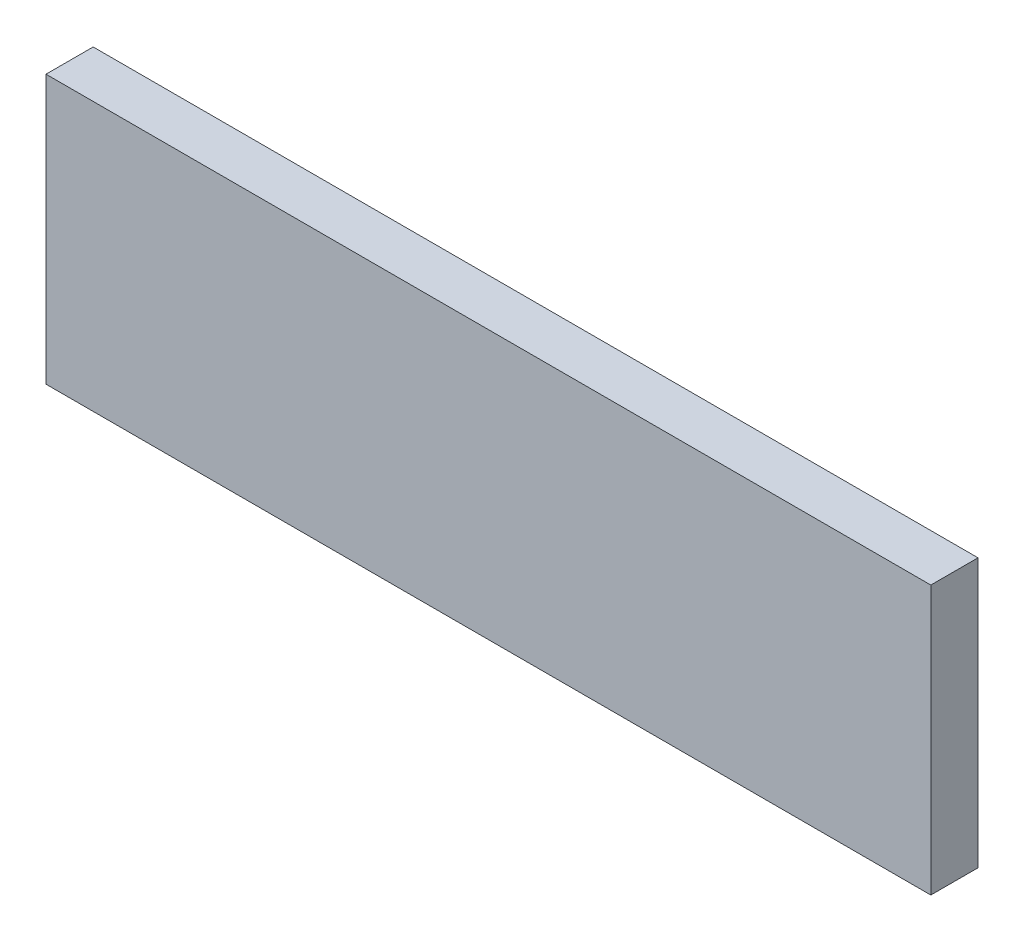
ISO-10303-21;
HEADER;
FILE_DESCRIPTION(('STEP AP214'),'2;1');
FILE_NAME('part.step','',(''),(''),'','','');
FILE_SCHEMA(('AUTOMOTIVE_DESIGN { 1 0 10303 214 1 1 1 1 }'));
ENDSEC;
DATA;
#1=APPLICATION_CONTEXT('core data for automotive mechanical design processes');
#2=APPLICATION_PROTOCOL_DEFINITION('international standard','automotive_design',2000,#1);
#3=PRODUCT_CONTEXT('',#1,'mechanical');
#4=PRODUCT('Part','Part','',(#3));
#5=PRODUCT_RELATED_PRODUCT_CATEGORY('part','',(#4));
#6=PRODUCT_DEFINITION_FORMATION('','',#4);
#7=PRODUCT_DEFINITION_CONTEXT('part definition',#1,'design');
#8=PRODUCT_DEFINITION('design','',#6,#7);
#9=PRODUCT_DEFINITION_SHAPE('','',#8);
#10=(LENGTH_UNIT() NAMED_UNIT(*) SI_UNIT(.MILLI.,.METRE.));
#11=(NAMED_UNIT(*) PLANE_ANGLE_UNIT() SI_UNIT($,.RADIAN.));
#12=(NAMED_UNIT(*) SI_UNIT($,.STERADIAN.) SOLID_ANGLE_UNIT());
#13=UNCERTAINTY_MEASURE_WITH_UNIT(LENGTH_MEASURE(1.E-05),#10,'distance_accuracy_value','');
#14=(GEOMETRIC_REPRESENTATION_CONTEXT(3) GLOBAL_UNCERTAINTY_ASSIGNED_CONTEXT((#13)) GLOBAL_UNIT_ASSIGNED_CONTEXT((#10,
#11,#12)) REPRESENTATION_CONTEXT('',''));
#15=CARTESIAN_POINT('',(0.,0.,0.));
#16=DIRECTION('',(0.,0.,1.));
#17=DIRECTION('',(1.,0.,0.));
#18=AXIS2_PLACEMENT_3D('',#15,#16,#17);
#19=CARTESIAN_POINT('',(1.29999994,42.81000074,4.50000116));
#20=DIRECTION('',(0.,0.,-1.));
#21=DIRECTION('',(-1.,0.,0.));
#22=AXIS2_PLACEMENT_3D('',#19,#20,#21);
#23=PLANE('',#22);
#24=DIRECTION('',(1.,0.,0.));
#25=VECTOR('',#24,1.);
#26=CARTESIAN_POINT('',(1.29999994,17.20000116,4.50000116));
#27=LINE('',#26,#25);
#28=CARTESIAN_POINT('',(1.29999994,17.20000116,4.50000116));
#29=VERTEX_POINT('',#28);
#30=CARTESIAN_POINT('',(85.69999878,17.20000116,4.50000116));
#31=VERTEX_POINT('',#30);
#32=EDGE_CURVE('E55',#29,#31,#27,.T.);
#33=ORIENTED_EDGE('',*,*,#32,.T.);
#34=DIRECTION('',(0.,1.,0.));
#35=VECTOR('',#34,1.);
#36=CARTESIAN_POINT('',(85.69999878,17.20000116,4.50000116));
#37=LINE('',#36,#35);
#38=CARTESIAN_POINT('',(85.69999878,42.81000074,4.50000116));
#39=VERTEX_POINT('',#38);
#40=EDGE_CURVE('E57',#31,#39,#37,.T.);
#41=ORIENTED_EDGE('',*,*,#40,.T.);
#42=DIRECTION('',(1.,0.,0.));
#43=VECTOR('',#42,1.);
#44=CARTESIAN_POINT('',(85.69999878,42.81000074,4.50000116));
#45=LINE('',#44,#43);
#46=CARTESIAN_POINT('',(1.29999994,42.81000074,4.50000116));
#47=VERTEX_POINT('',#46);
#48=EDGE_CURVE('E20',#39,#47,#45,.F.);
#49=ORIENTED_EDGE('',*,*,#48,.T.);
#50=DIRECTION('',(0.,1.,0.));
#51=VECTOR('',#50,1.);
#52=CARTESIAN_POINT('',(1.29999994,42.81000074,4.50000116));
#53=LINE('',#52,#51);
#54=EDGE_CURVE('E80',#47,#29,#53,.F.);
#55=ORIENTED_EDGE('',*,*,#54,.T.);
#56=EDGE_LOOP('',(#33,#41,#49,#55));
#57=FACE_BOUND('',#56,.T.);
#58=ADVANCED_FACE('F17',(#57),#23,.F.);
#59=CARTESIAN_POINT('',(85.69999878,42.81000074,0.));
#60=DIRECTION('',(0.,-1.,0.));
#61=DIRECTION('',(0.,0.,-1.));
#62=AXIS2_PLACEMENT_3D('',#59,#60,#61);
#63=PLANE('',#62);
#64=DIRECTION('',(0.,0.,-1.));
#65=VECTOR('',#64,1.);
#66=CARTESIAN_POINT('',(1.29999994,42.81000074,0.));
#67=LINE('',#66,#65);
#68=CARTESIAN_POINT('',(1.29999994,42.81000074,0.));
#69=VERTEX_POINT('',#68);
#70=EDGE_CURVE('E68',#69,#47,#67,.F.);
#71=ORIENTED_EDGE('',*,*,#70,.T.);
#72=ORIENTED_EDGE('',*,*,#48,.F.);
#73=DIRECTION('',(0.,0.,1.));
#74=VECTOR('',#73,1.);
#75=CARTESIAN_POINT('',(85.69999878,42.81000074,0.));
#76=LINE('',#75,#74);
#77=CARTESIAN_POINT('',(85.69999878,42.81000074,0.));
#78=VERTEX_POINT('',#77);
#79=EDGE_CURVE('E63',#39,#78,#76,.F.);
#80=ORIENTED_EDGE('',*,*,#79,.T.);
#81=DIRECTION('',(-1.,0.,0.));
#82=VECTOR('',#81,1.);
#83=CARTESIAN_POINT('',(1.29999994,42.81000074,0.));
#84=LINE('',#83,#82);
#85=EDGE_CURVE('E83',#69,#78,#84,.F.);
#86=ORIENTED_EDGE('',*,*,#85,.F.);
#87=EDGE_LOOP('',(#71,#72,#80,#86));
#88=FACE_BOUND('',#87,.T.);
#89=ADVANCED_FACE('F65',(#88),#63,.F.);
#90=CARTESIAN_POINT('',(85.69999878,17.20000116,0.));
#91=DIRECTION('',(-1.,0.,0.));
#92=DIRECTION('',(0.,0.,1.));
#93=AXIS2_PLACEMENT_3D('',#90,#91,#92);
#94=PLANE('',#93);
#95=ORIENTED_EDGE('',*,*,#79,.F.);
#96=ORIENTED_EDGE('',*,*,#40,.F.);
#97=DIRECTION('',(0.,0.,1.));
#98=VECTOR('',#97,1.);
#99=CARTESIAN_POINT('',(85.69999878,17.20000116,0.));
#100=LINE('',#99,#98);
#101=CARTESIAN_POINT('',(85.69999878,17.20000116,0.));
#102=VERTEX_POINT('',#101);
#103=EDGE_CURVE('E75',#31,#102,#100,.F.);
#104=ORIENTED_EDGE('',*,*,#103,.T.);
#105=DIRECTION('',(0.,1.,0.));
#106=VECTOR('',#105,1.);
#107=CARTESIAN_POINT('',(85.69999878,42.81000074,0.));
#108=LINE('',#107,#106);
#109=EDGE_CURVE('E72',#78,#102,#108,.F.);
#110=ORIENTED_EDGE('',*,*,#109,.F.);
#111=EDGE_LOOP('',(#95,#96,#104,#110));
#112=FACE_BOUND('',#111,.T.);
#113=ADVANCED_FACE('F70',(#112),#94,.F.);
#114=CARTESIAN_POINT('',(1.29999994,17.20000116,0.));
#115=DIRECTION('',(0.,1.,0.));
#116=DIRECTION('',(0.,0.,1.));
#117=AXIS2_PLACEMENT_3D('',#114,#115,#116);
#118=PLANE('',#117);
#119=ORIENTED_EDGE('',*,*,#103,.F.);
#120=ORIENTED_EDGE('',*,*,#32,.F.);
#121=DIRECTION('',(0.,0.,-1.));
#122=VECTOR('',#121,1.);
#123=CARTESIAN_POINT('',(1.29999994,17.20000116,0.));
#124=LINE('',#123,#122);
#125=CARTESIAN_POINT('',(1.29999994,17.20000116,0.));
#126=VERTEX_POINT('',#125);
#127=EDGE_CURVE('E35',#29,#126,#124,.T.);
#128=ORIENTED_EDGE('',*,*,#127,.T.);
#129=DIRECTION('',(-1.,0.,0.));
#130=VECTOR('',#129,1.);
#131=CARTESIAN_POINT('',(1.29999994,17.20000116,0.));
#132=LINE('',#131,#130);
#133=EDGE_CURVE('E26',#102,#126,#132,.T.);
#134=ORIENTED_EDGE('',*,*,#133,.F.);
#135=EDGE_LOOP('',(#119,#120,#128,#134));
#136=FACE_BOUND('',#135,.T.);
#137=ADVANCED_FACE('F89',(#136),#118,.F.);
#138=CARTESIAN_POINT('',(1.29999994,42.81000074,0.));
#139=DIRECTION('',(1.,0.,0.));
#140=DIRECTION('',(0.,0.,-1.));
#141=AXIS2_PLACEMENT_3D('',#138,#139,#140);
#142=PLANE('',#141);
#143=ORIENTED_EDGE('',*,*,#127,.F.);
#144=ORIENTED_EDGE('',*,*,#54,.F.);
#145=ORIENTED_EDGE('',*,*,#70,.F.);
#146=DIRECTION('',(0.,1.,0.));
#147=VECTOR('',#146,1.);
#148=CARTESIAN_POINT('',(1.29999994,42.81000074,0.));
#149=LINE('',#148,#147);
#150=EDGE_CURVE('E11',#126,#69,#149,.T.);
#151=ORIENTED_EDGE('',*,*,#150,.F.);
#152=EDGE_LOOP('',(#143,#144,#145,#151));
#153=FACE_BOUND('',#152,.T.);
#154=ADVANCED_FACE('F91',(#153),#142,.F.);
#155=CARTESIAN_POINT('',(1.29999994,42.81000074,0.));
#156=DIRECTION('',(0.,0.,-1.));
#157=DIRECTION('',(-1.,0.,0.));
#158=AXIS2_PLACEMENT_3D('',#155,#156,#157);
#159=PLANE('',#158);
#160=ORIENTED_EDGE('',*,*,#133,.T.);
#161=ORIENTED_EDGE('',*,*,#150,.T.);
#162=ORIENTED_EDGE('',*,*,#85,.T.);
#163=ORIENTED_EDGE('',*,*,#109,.T.);
#164=EDGE_LOOP('',(#160,#161,#162,#163));
#165=FACE_BOUND('',#164,.T.);
#166=ADVANCED_FACE('F88',(#165),#159,.T.);
#167=CLOSED_SHELL('',(#58,#89,#113,#137,#154,#166));
#168=MANIFOLD_SOLID_BREP('B1',#167);
#169=ADVANCED_BREP_SHAPE_REPRESENTATION('',(#18,#168),#14);
#170=SHAPE_DEFINITION_REPRESENTATION(#9,#169);
ENDSEC;
END-ISO-10303-21;
